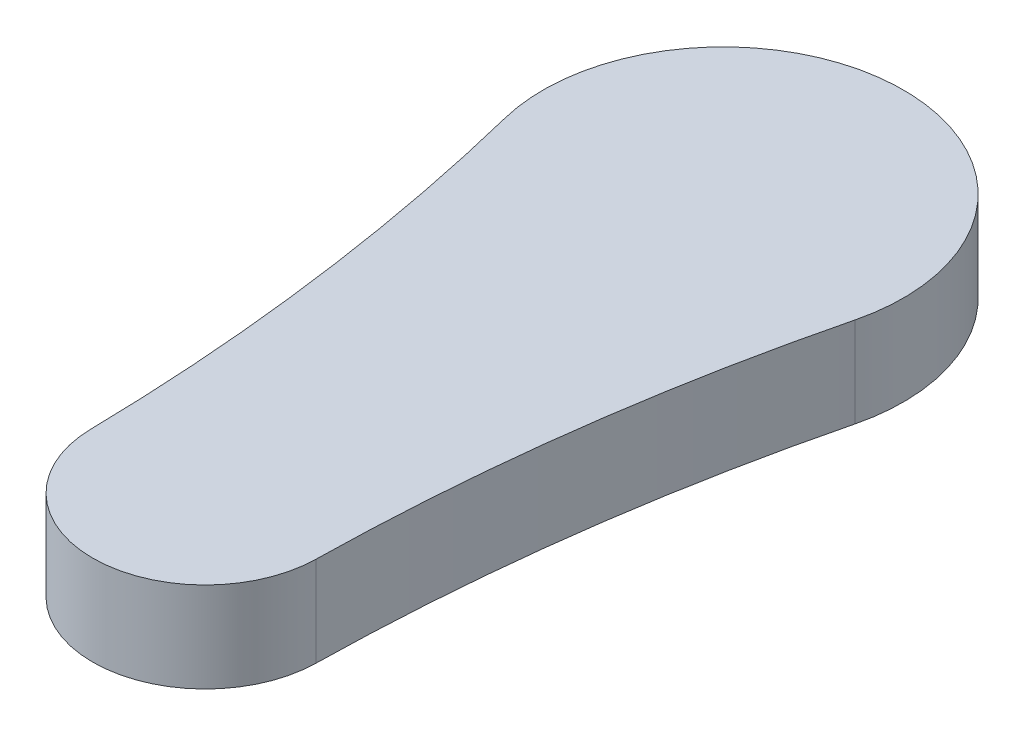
from build123d import *

# Parameters (mm, degrees)
EXTRUDE1_DEPTH = 50.8


with BuildPart() as part:
    # Sketch1 → Extrude1 (new body)
    with BuildSketch(Plane(origin=(0, 0, 0), x_dir=(1, 0, 0), z_dir=(0, 1, 0))):
        with BuildLine():
            ThreePointArc((98.613110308, 267.645665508), (73.445172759, 134.281968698), (63.490980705, -1.070219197))
            ThreePointArc((63.490980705, -1.070219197), (0, -63.5), (-63.490980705, -1.070219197))
            ThreePointArc((-63.490980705, -1.070219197), (-73.445172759, 134.281968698), (-98.613110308, 267.645665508))
            ThreePointArc((-98.613110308, 267.645665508), (0, 393.7), (98.613110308, 267.645665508))
        make_face()
    extrude(amount=EXTRUDE1_DEPTH)


solid = part.part
